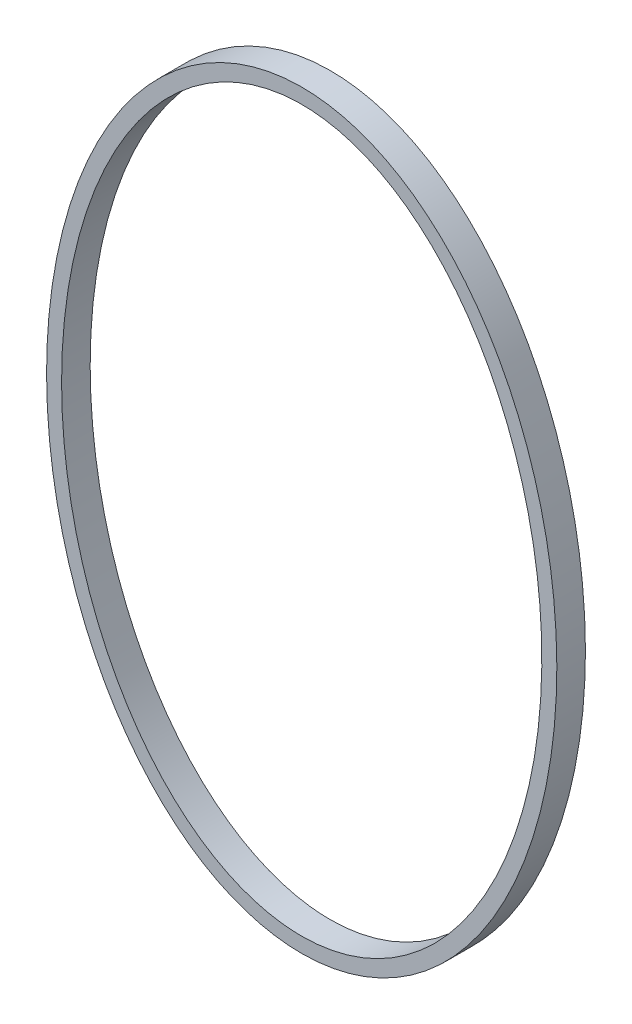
ISO-10303-21;
HEADER;
FILE_DESCRIPTION(('STEP AP214'),'2;1');
FILE_NAME('part.step','',(''),(''),'','','');
FILE_SCHEMA(('AUTOMOTIVE_DESIGN { 1 0 10303 214 1 1 1 1 }'));
ENDSEC;
DATA;
#1=APPLICATION_CONTEXT('core data for automotive mechanical design processes');
#2=APPLICATION_PROTOCOL_DEFINITION('international standard','automotive_design',2000,#1);
#3=PRODUCT_CONTEXT('',#1,'mechanical');
#4=PRODUCT('Part','Part','',(#3));
#5=PRODUCT_RELATED_PRODUCT_CATEGORY('part','',(#4));
#6=PRODUCT_DEFINITION_FORMATION('','',#4);
#7=PRODUCT_DEFINITION_CONTEXT('part definition',#1,'design');
#8=PRODUCT_DEFINITION('design','',#6,#7);
#9=PRODUCT_DEFINITION_SHAPE('','',#8);
#10=(LENGTH_UNIT() NAMED_UNIT(*) SI_UNIT(.MILLI.,.METRE.));
#11=(NAMED_UNIT(*) PLANE_ANGLE_UNIT() SI_UNIT($,.RADIAN.));
#12=(NAMED_UNIT(*) SI_UNIT($,.STERADIAN.) SOLID_ANGLE_UNIT());
#13=UNCERTAINTY_MEASURE_WITH_UNIT(LENGTH_MEASURE(1.E-05),#10,'distance_accuracy_value','');
#14=(GEOMETRIC_REPRESENTATION_CONTEXT(3) GLOBAL_UNCERTAINTY_ASSIGNED_CONTEXT((#13)) GLOBAL_UNIT_ASSIGNED_CONTEXT((#10,
#11,#12)) REPRESENTATION_CONTEXT('',''));
#15=CARTESIAN_POINT('',(0.,0.,0.));
#16=DIRECTION('',(0.,0.,1.));
#17=DIRECTION('',(1.,0.,0.));
#18=AXIS2_PLACEMENT_3D('',#15,#16,#17);
#19=CARTESIAN_POINT('',(0.,-62.5,-4.7625));
#20=CARTESIAN_POINT('',(2.86301211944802,-62.5,-4.7625));
#21=CARTESIAN_POINT('',(8.58903635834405,-61.6509973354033,-4.7625));
#22=CARTESIAN_POINT('',(19.4759630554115,-56.687057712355,-4.7625));
#23=CARTESIAN_POINT('',(31.1718174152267,-44.9055748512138,-4.7625));
#24=CARTESIAN_POINT('',(40.362320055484,-24.2132904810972,-4.7625));
#25=CARTESIAN_POINT('',(43.568839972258,0.,-4.7625));
#26=CARTESIAN_POINT('',(40.362320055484,24.2132904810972,-4.7625));
#27=CARTESIAN_POINT('',(31.1718174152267,44.9055748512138,-4.7625));
#28=CARTESIAN_POINT('',(19.4759630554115,56.687057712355,-4.7625));
#29=CARTESIAN_POINT('',(8.58903635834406,61.6509973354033,-4.7625));
#30=CARTESIAN_POINT('',(0.,62.9245013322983,-4.7625));
#31=CARTESIAN_POINT('',(-8.58903635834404,61.6509973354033,-4.7625));
#32=CARTESIAN_POINT('',(-19.4759630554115,56.687057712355,-4.7625));
#33=CARTESIAN_POINT('',(-31.1718174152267,44.9055748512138,-4.7625));
#34=CARTESIAN_POINT('',(-40.362320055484,24.2132904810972,-4.7625));
#35=CARTESIAN_POINT('',(-43.568839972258,0.,-4.7625));
#36=CARTESIAN_POINT('',(-40.362320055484,-24.2132904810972,-4.7625));
#37=CARTESIAN_POINT('',(-31.1718174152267,-44.9055748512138,-4.7625));
#38=CARTESIAN_POINT('',(-19.4759630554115,-56.687057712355,-4.7625));
#39=CARTESIAN_POINT('',(-8.58903635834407,-61.6509973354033,-4.7625));
#40=CARTESIAN_POINT('',(-2.86301211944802,-62.5,-4.7625));
#41=CARTESIAN_POINT('',(0.,-62.5,-4.7625));
#42=B_SPLINE_CURVE_WITH_KNOTS('',3,(#19,#20,#21,#22,#23,#24,#25,#26,#27,#28,#29,#30,#31,#32,#33,
#34,#35,#36,#37,#38,#39,#40,#41),.UNSPECIFIED.,.T.,.F.,(4,1,1,1,1,1,1,1,1,1,1,1,1,1,1,1,1,1,1,1,
4),(0.,0.196349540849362,0.392699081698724,0.785398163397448,1.17809724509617,1.5707963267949,
1.96349540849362,2.35619449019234,2.74889357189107,2.94524311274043,3.14159265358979,
3.33794219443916,3.53429173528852,3.92699081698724,4.31968989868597,4.71238898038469,
5.10508806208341,5.49778714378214,5.89048622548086,6.08683576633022,6.28318530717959),.UNSPECIFIED.);
#43=DIRECTION('',(0.,0.,1.));
#44=VECTOR('',#43,1.);
#45=SURFACE_OF_LINEAR_EXTRUSION('',#42,#44);
#46=CARTESIAN_POINT('',(0.,-62.5,-4.7625));
#47=VERTEX_POINT('',#46);
#48=EDGE_CURVE('E10',#47,#47,#42,.T.);
#49=ORIENTED_EDGE('',*,*,#48,.T.);
#50=EDGE_LOOP('',(#49));
#51=FACE_BOUND('',#50,.T.);
#52=CARTESIAN_POINT('',(0.,-62.5,0.));
#53=CARTESIAN_POINT('',(2.86301211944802,-62.5,0.));
#54=CARTESIAN_POINT('',(8.58903635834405,-61.6509973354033,0.));
#55=CARTESIAN_POINT('',(19.4759630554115,-56.687057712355,0.));
#56=CARTESIAN_POINT('',(31.1718174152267,-44.9055748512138,0.));
#57=CARTESIAN_POINT('',(40.362320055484,-24.2132904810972,0.));
#58=CARTESIAN_POINT('',(43.568839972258,0.,0.));
#59=CARTESIAN_POINT('',(40.362320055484,24.2132904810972,0.));
#60=CARTESIAN_POINT('',(31.1718174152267,44.9055748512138,0.));
#61=CARTESIAN_POINT('',(19.4759630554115,56.687057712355,0.));
#62=CARTESIAN_POINT('',(8.58903635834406,61.6509973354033,0.));
#63=CARTESIAN_POINT('',(0.,62.9245013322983,0.));
#64=CARTESIAN_POINT('',(-8.58903635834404,61.6509973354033,0.));
#65=CARTESIAN_POINT('',(-19.4759630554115,56.687057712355,0.));
#66=CARTESIAN_POINT('',(-31.1718174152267,44.9055748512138,0.));
#67=CARTESIAN_POINT('',(-40.362320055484,24.2132904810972,0.));
#68=CARTESIAN_POINT('',(-43.568839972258,0.,0.));
#69=CARTESIAN_POINT('',(-40.362320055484,-24.2132904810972,0.));
#70=CARTESIAN_POINT('',(-31.1718174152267,-44.9055748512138,0.));
#71=CARTESIAN_POINT('',(-19.4759630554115,-56.687057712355,0.));
#72=CARTESIAN_POINT('',(-8.58903635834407,-61.6509973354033,0.));
#73=CARTESIAN_POINT('',(-2.86301211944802,-62.5,0.));
#74=CARTESIAN_POINT('',(0.,-62.5,0.));
#75=B_SPLINE_CURVE_WITH_KNOTS('',3,(#52,#53,#54,#55,#56,#57,#58,#59,#60,#61,#62,#63,#64,#65,#66,
#67,#68,#69,#70,#71,#72,#73,#74),.UNSPECIFIED.,.T.,.F.,(4,1,1,1,1,1,1,1,1,1,1,1,1,1,1,1,1,1,1,1,
4),(0.,0.196349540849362,0.392699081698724,0.785398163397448,1.17809724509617,1.5707963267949,
1.96349540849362,2.35619449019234,2.74889357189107,2.94524311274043,3.14159265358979,
3.33794219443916,3.53429173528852,3.92699081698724,4.31968989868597,4.71238898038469,
5.10508806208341,5.49778714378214,5.89048622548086,6.08683576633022,6.28318530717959),.UNSPECIFIED.);
#76=CARTESIAN_POINT('',(0.,-62.5,0.));
#77=VERTEX_POINT('',#76);
#78=EDGE_CURVE('E41',#77,#77,#75,.T.);
#79=ORIENTED_EDGE('',*,*,#78,.F.);
#80=EDGE_LOOP('',(#79));
#81=FACE_BOUND('',#80,.T.);
#82=ADVANCED_FACE('F37',(#51,#81),#45,.T.);
#83=CARTESIAN_POINT('',(0.,62.5,-4.7625));
#84=DIRECTION('',(0.,0.,-1.));
#85=DIRECTION('',(-1.,0.,0.));
#86=AXIS2_PLACEMENT_3D('',#83,#84,#85);
#87=PLANE('',#86);
#88=CARTESIAN_POINT('',(0.,0.,-4.7625));
#89=DIRECTION('',(0.,0.,1.));
#90=DIRECTION('',(0.,-1.,0.));
#91=AXIS2_PLACEMENT_3D('',#88,#89,#90);
#92=ELLIPSE('',#91,60.,40.);
#93=CARTESIAN_POINT('',(0.,-60.,-4.7625));
#94=VERTEX_POINT('',#93);
#95=EDGE_CURVE('E51',#94,#94,#92,.T.);
#96=ORIENTED_EDGE('',*,*,#95,.T.);
#97=EDGE_LOOP('',(#96));
#98=FACE_BOUND('',#97,.T.);
#99=ORIENTED_EDGE('',*,*,#48,.F.);
#100=EDGE_LOOP('',(#99));
#101=FACE_BOUND('',#100,.T.);
#102=ADVANCED_FACE('F72',(#98,#101),#87,.T.);
#103=CARTESIAN_POINT('',(0.,62.5,0.));
#104=DIRECTION('',(0.,0.,-1.));
#105=DIRECTION('',(-1.,0.,0.));
#106=AXIS2_PLACEMENT_3D('',#103,#104,#105);
#107=PLANE('',#106);
#108=CARTESIAN_POINT('',(0.,0.,0.));
#109=DIRECTION('',(0.,0.,1.));
#110=DIRECTION('',(0.,-1.,0.));
#111=AXIS2_PLACEMENT_3D('',#108,#109,#110);
#112=ELLIPSE('',#111,60.,40.);
#113=CARTESIAN_POINT('',(0.,-60.,0.));
#114=VERTEX_POINT('',#113);
#115=EDGE_CURVE('E56',#114,#114,#112,.T.);
#116=ORIENTED_EDGE('',*,*,#115,.F.);
#117=EDGE_LOOP('',(#116));
#118=FACE_BOUND('',#117,.T.);
#119=ORIENTED_EDGE('',*,*,#78,.T.);
#120=EDGE_LOOP('',(#119));
#121=FACE_BOUND('',#120,.T.);
#122=ADVANCED_FACE('F70',(#118,#121),#107,.F.);
#123=DIRECTION('',(0.,0.,1.));
#124=VECTOR('',#123,1.);
#125=SURFACE_OF_LINEAR_EXTRUSION('',#92,#124);
#126=ORIENTED_EDGE('',*,*,#95,.F.);
#127=EDGE_LOOP('',(#126));
#128=FACE_BOUND('',#127,.T.);
#129=ORIENTED_EDGE('',*,*,#115,.T.);
#130=EDGE_LOOP('',(#129));
#131=FACE_BOUND('',#130,.T.);
#132=ADVANCED_FACE('F67',(#128,#131),#125,.F.);
#133=CLOSED_SHELL('',(#82,#102,#122,#132));
#134=MANIFOLD_SOLID_BREP('B2',#133);
#135=ADVANCED_BREP_SHAPE_REPRESENTATION('',(#18,#134),#14);
#136=SHAPE_DEFINITION_REPRESENTATION(#9,#135);
ENDSEC;
END-ISO-10303-21;
